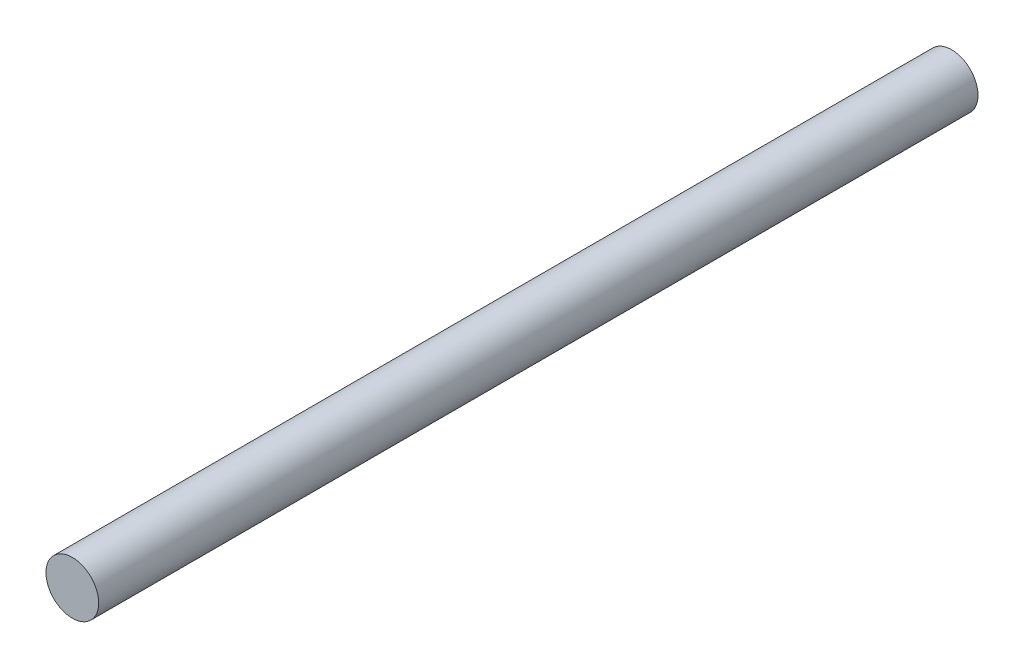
from build123d import *

# Parameters (mm, degrees)
SKETCH1_R           = 30
BOSS_EXTRUDE1_DEPTH = 1000


with BuildPart() as part:
    # Sketch1 → Boss-Extrude1 (new body)
    with BuildSketch(Plane.XY):
        Circle(SKETCH1_R)
    extrude(amount=-BOSS_EXTRUDE1_DEPTH)


solid = part.part
